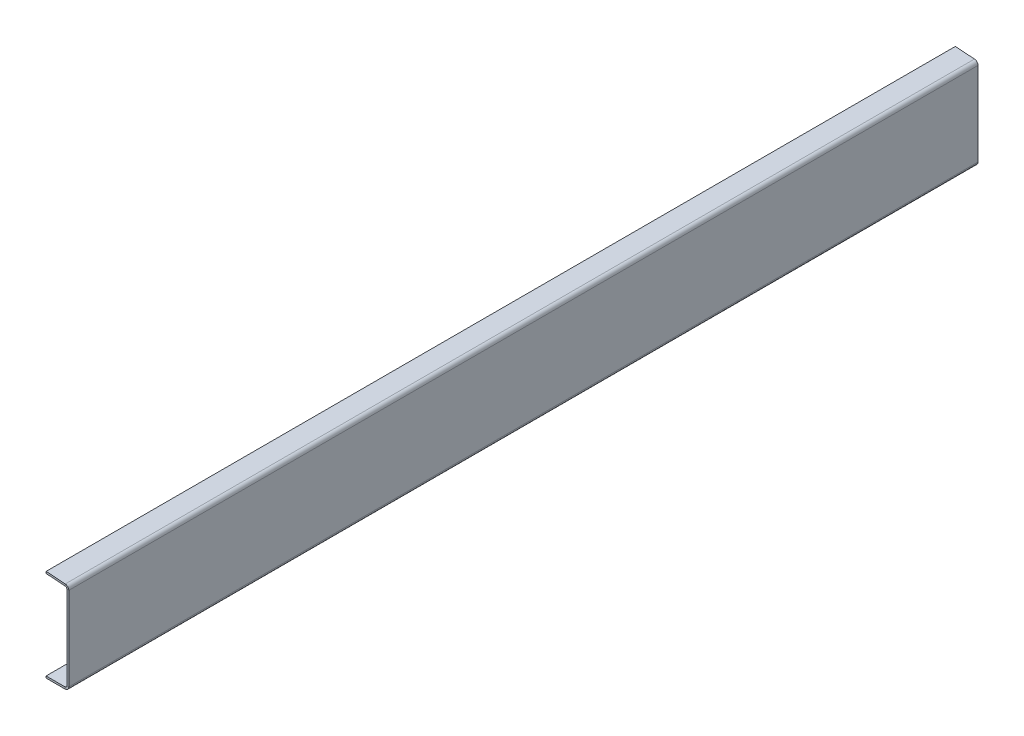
ISO-10303-21;
HEADER;
FILE_DESCRIPTION(('STEP AP214'),'2;1');
FILE_NAME('part.step','',(''),(''),'','','');
FILE_SCHEMA(('AUTOMOTIVE_DESIGN { 1 0 10303 214 1 1 1 1 }'));
ENDSEC;
DATA;
#1=APPLICATION_CONTEXT('core data for automotive mechanical design processes');
#2=APPLICATION_PROTOCOL_DEFINITION('international standard','automotive_design',2000,#1);
#3=PRODUCT_CONTEXT('',#1,'mechanical');
#4=PRODUCT('Part','Part','',(#3));
#5=PRODUCT_RELATED_PRODUCT_CATEGORY('part','',(#4));
#6=PRODUCT_DEFINITION_FORMATION('','',#4);
#7=PRODUCT_DEFINITION_CONTEXT('part definition',#1,'design');
#8=PRODUCT_DEFINITION('design','',#6,#7);
#9=PRODUCT_DEFINITION_SHAPE('','',#8);
#10=(LENGTH_UNIT() NAMED_UNIT(*) SI_UNIT(.MILLI.,.METRE.));
#11=(NAMED_UNIT(*) PLANE_ANGLE_UNIT() SI_UNIT($,.RADIAN.));
#12=(NAMED_UNIT(*) SI_UNIT($,.STERADIAN.) SOLID_ANGLE_UNIT());
#13=UNCERTAINTY_MEASURE_WITH_UNIT(LENGTH_MEASURE(1.E-05),#10,'distance_accuracy_value','');
#14=(GEOMETRIC_REPRESENTATION_CONTEXT(3) GLOBAL_UNCERTAINTY_ASSIGNED_CONTEXT((#13)) GLOBAL_UNIT_ASSIGNED_CONTEXT((#10,
#11,#12)) REPRESENTATION_CONTEXT('',''));
#15=CARTESIAN_POINT('',(0.,0.,0.));
#16=DIRECTION('',(0.,0.,1.));
#17=DIRECTION('',(1.,0.,0.));
#18=AXIS2_PLACEMENT_3D('',#15,#16,#17);
#19=CARTESIAN_POINT('',(0.,292.957058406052,3048.));
#20=DIRECTION('',(0.,0.,1.));
#21=DIRECTION('',(1.,0.,0.));
#22=AXIS2_PLACEMENT_3D('',#19,#20,#21);
#23=PLANE('',#22);
#24=DIRECTION('',(-1.,0.,0.));
#25=VECTOR('',#24,1.);
#26=CARTESIAN_POINT('',(0.,292.957058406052,3048.));
#27=LINE('',#26,#25);
#28=CARTESIAN_POINT('',(0.,292.957058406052,3048.));
#29=VERTEX_POINT('',#28);
#30=CARTESIAN_POINT('',(-6.35,292.957058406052,3048.));
#31=VERTEX_POINT('',#30);
#32=EDGE_CURVE('E11',#29,#31,#27,.T.);
#33=ORIENTED_EDGE('',*,*,#32,.F.);
#34=CARTESIAN_POINT('',(-12.7,292.957058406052,3048.));
#35=DIRECTION('',(0.,0.,1.));
#36=DIRECTION('',(1.,0.,0.));
#37=AXIS2_PLACEMENT_3D('',#34,#35,#36);
#38=CIRCLE('',#37,12.7);
#39=CARTESIAN_POINT('',(-11.8140927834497,305.626121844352,3048.));
#40=VERTEX_POINT('',#39);
#41=EDGE_CURVE('E171',#29,#40,#38,.T.);
#42=ORIENTED_EDGE('',*,*,#41,.T.);
#43=DIRECTION('',(0.069756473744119,0.997564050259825,0.));
#44=VECTOR('',#43,1.);
#45=CARTESIAN_POINT('',(-12.2570463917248,299.291590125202,3048.));
#46=LINE('',#45,#44);
#47=CARTESIAN_POINT('',(-12.2570463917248,299.291590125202,3048.));
#48=VERTEX_POINT('',#47);
#49=EDGE_CURVE('E46',#48,#40,#46,.T.);
#50=ORIENTED_EDGE('',*,*,#49,.F.);
#51=CARTESIAN_POINT('',(-12.7,292.957058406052,3048.));
#52=DIRECTION('',(0.,0.,1.));
#53=DIRECTION('',(1.,0.,0.));
#54=AXIS2_PLACEMENT_3D('',#51,#52,#53);
#55=CIRCLE('',#54,6.35);
#56=EDGE_CURVE('E247',#31,#48,#55,.T.);
#57=ORIENTED_EDGE('',*,*,#56,.F.);
#58=EDGE_LOOP('',(#33,#42,#50,#57));
#59=FACE_BOUND('',#58,.T.);
#60=ADVANCED_FACE('F38',(#59),#23,.T.);
#61=CARTESIAN_POINT('',(-12.2570463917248,299.291590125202,3048.));
#62=DIRECTION('',(0.,0.,1.));
#63=DIRECTION('',(1.,0.,0.));
#64=AXIS2_PLACEMENT_3D('',#61,#62,#63);
#65=PLANE('',#64);
#66=DIRECTION('',(0.,1.,0.));
#67=VECTOR('',#66,1.);
#68=CARTESIAN_POINT('',(0.,0.,3048.));
#69=LINE('',#68,#67);
#70=CARTESIAN_POINT('',(0.,12.7,3048.));
#71=VERTEX_POINT('',#70);
#72=EDGE_CURVE('E138',#71,#29,#69,.T.);
#73=ORIENTED_EDGE('',*,*,#72,.T.);
#74=ORIENTED_EDGE('',*,*,#32,.T.);
#75=DIRECTION('',(0.,1.,0.));
#76=VECTOR('',#75,1.);
#77=CARTESIAN_POINT('',(-6.35,0.,3048.));
#78=LINE('',#77,#76);
#79=CARTESIAN_POINT('',(-6.35,12.7,3048.));
#80=VERTEX_POINT('',#79);
#81=EDGE_CURVE('E141',#80,#31,#78,.T.);
#82=ORIENTED_EDGE('',*,*,#81,.F.);
#83=DIRECTION('',(1.,0.,0.));
#84=VECTOR('',#83,1.);
#85=CARTESIAN_POINT('',(-6.35,12.7,3048.));
#86=LINE('',#85,#84);
#87=EDGE_CURVE('E134',#80,#71,#86,.T.);
#88=ORIENTED_EDGE('',*,*,#87,.T.);
#89=EDGE_LOOP('',(#73,#74,#82,#88));
#90=FACE_BOUND('',#89,.T.);
#91=ADVANCED_FACE('F136',(#90),#65,.T.);
#92=CARTESIAN_POINT('',(-11.8140927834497,305.626121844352,0.));
#93=DIRECTION('',(0.,0.,-1.));
#94=DIRECTION('',(-1.,0.,0.));
#95=AXIS2_PLACEMENT_3D('',#92,#93,#94);
#96=PLANE('',#95);
#97=DIRECTION('',(-0.069756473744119,-0.997564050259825,0.));
#98=VECTOR('',#97,1.);
#99=CARTESIAN_POINT('',(-11.8140927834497,305.626121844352,0.));
#100=LINE('',#99,#98);
#101=CARTESIAN_POINT('',(-11.8140927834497,305.626121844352,0.));
#102=VERTEX_POINT('',#101);
#103=CARTESIAN_POINT('',(-12.2570463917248,299.291590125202,0.));
#104=VERTEX_POINT('',#103);
#105=EDGE_CURVE('E101',#102,#104,#100,.T.);
#106=ORIENTED_EDGE('',*,*,#105,.F.);
#107=CARTESIAN_POINT('',(-12.7,292.957058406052,0.));
#108=DIRECTION('',(0.,0.,1.));
#109=DIRECTION('',(1.,0.,0.));
#110=AXIS2_PLACEMENT_3D('',#107,#108,#109);
#111=CIRCLE('',#110,12.7);
#112=CARTESIAN_POINT('',(0.,292.957058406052,0.));
#113=VERTEX_POINT('',#112);
#114=EDGE_CURVE('E205',#113,#102,#111,.T.);
#115=ORIENTED_EDGE('',*,*,#114,.F.);
#116=DIRECTION('',(1.,0.,0.));
#117=VECTOR('',#116,1.);
#118=CARTESIAN_POINT('',(-6.35,292.957058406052,0.));
#119=LINE('',#118,#117);
#120=CARTESIAN_POINT('',(-6.35,292.957058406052,0.));
#121=VERTEX_POINT('',#120);
#122=EDGE_CURVE('E94',#121,#113,#119,.T.);
#123=ORIENTED_EDGE('',*,*,#122,.F.);
#124=CARTESIAN_POINT('',(-12.7,292.957058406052,0.));
#125=DIRECTION('',(0.,0.,1.));
#126=DIRECTION('',(1.,0.,0.));
#127=AXIS2_PLACEMENT_3D('',#124,#125,#126);
#128=CIRCLE('',#127,6.35);
#129=EDGE_CURVE('E186',#121,#104,#128,.T.);
#130=ORIENTED_EDGE('',*,*,#129,.T.);
#131=EDGE_LOOP('',(#106,#115,#123,#130));
#132=FACE_BOUND('',#131,.T.);
#133=ADVANCED_FACE('F252',(#132),#96,.T.);
#134=CARTESIAN_POINT('',(-6.35,292.957058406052,0.));
#135=DIRECTION('',(0.,0.,-1.));
#136=DIRECTION('',(-1.,0.,0.));
#137=AXIS2_PLACEMENT_3D('',#134,#135,#136);
#138=PLANE('',#137);
#139=DIRECTION('',(-0.997564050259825,0.0697564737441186,0.));
#140=VECTOR('',#139,1.);
#141=CARTESIAN_POINT('',(0.,304.8,0.));
#142=LINE('',#141,#140);
#143=CARTESIAN_POINT('',(-76.0143806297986,310.115443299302,0.));
#144=VERTEX_POINT('',#143);
#145=EDGE_CURVE('E177',#102,#144,#142,.T.);
#146=ORIENTED_EDGE('',*,*,#145,.F.);
#147=ORIENTED_EDGE('',*,*,#105,.T.);
#148=DIRECTION('',(-0.997564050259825,0.0697564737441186,0.));
#149=VECTOR('',#148,1.);
#150=CARTESIAN_POINT('',(-0.442953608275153,298.46546828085,0.));
#151=LINE('',#150,#149);
#152=CARTESIAN_POINT('',(-76.4573342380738,303.780911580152,0.));
#153=VERTEX_POINT('',#152);
#154=EDGE_CURVE('E183',#104,#153,#151,.T.);
#155=ORIENTED_EDGE('',*,*,#154,.T.);
#156=DIRECTION('',(0.0697564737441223,0.997564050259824,0.));
#157=VECTOR('',#156,1.);
#158=CARTESIAN_POINT('',(-76.4573342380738,303.780911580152,0.));
#159=LINE('',#158,#157);
#160=EDGE_CURVE('E180',#153,#144,#159,.T.);
#161=ORIENTED_EDGE('',*,*,#160,.T.);
#162=EDGE_LOOP('',(#146,#147,#155,#161));
#163=FACE_BOUND('',#162,.T.);
#164=ADVANCED_FACE('F238',(#163),#138,.T.);
#165=CARTESIAN_POINT('',(-12.7,0.,3048.));
#166=DIRECTION('',(0.,0.,1.));
#167=DIRECTION('',(1.,0.,0.));
#168=AXIS2_PLACEMENT_3D('',#165,#166,#167);
#169=PLANE('',#168);
#170=DIRECTION('',(0.,1.,0.));
#171=VECTOR('',#170,1.);
#172=CARTESIAN_POINT('',(-12.7,0.,3048.));
#173=LINE('',#172,#171);
#174=CARTESIAN_POINT('',(-12.7,0.,3048.));
#175=VERTEX_POINT('',#174);
#176=CARTESIAN_POINT('',(-12.7,6.35,3048.));
#177=VERTEX_POINT('',#176);
#178=EDGE_CURVE('E146',#175,#177,#173,.T.);
#179=ORIENTED_EDGE('',*,*,#178,.F.);
#180=CARTESIAN_POINT('',(-12.7,12.7,3048.));
#181=DIRECTION('',(0.,0.,1.));
#182=DIRECTION('',(1.,0.,0.));
#183=AXIS2_PLACEMENT_3D('',#180,#181,#182);
#184=CIRCLE('',#183,12.7);
#185=EDGE_CURVE('E150',#175,#71,#184,.T.);
#186=ORIENTED_EDGE('',*,*,#185,.T.);
#187=ORIENTED_EDGE('',*,*,#87,.F.);
#188=CARTESIAN_POINT('',(-12.7,12.7,3048.));
#189=DIRECTION('',(0.,0.,1.));
#190=DIRECTION('',(1.,0.,0.));
#191=AXIS2_PLACEMENT_3D('',#188,#189,#190);
#192=CIRCLE('',#191,6.35);
#193=EDGE_CURVE('E259',#177,#80,#192,.T.);
#194=ORIENTED_EDGE('',*,*,#193,.F.);
#195=EDGE_LOOP('',(#179,#186,#187,#194));
#196=FACE_BOUND('',#195,.T.);
#197=ADVANCED_FACE('F152',(#196),#169,.T.);
#198=CARTESIAN_POINT('',(-6.35,12.7,3048.));
#199=DIRECTION('',(0.,0.,1.));
#200=DIRECTION('',(1.,0.,0.));
#201=AXIS2_PLACEMENT_3D('',#198,#199,#200);
#202=PLANE('',#201);
#203=DIRECTION('',(1.,0.,0.));
#204=VECTOR('',#203,1.);
#205=CARTESIAN_POINT('',(-76.2,0.,3048.));
#206=LINE('',#205,#204);
#207=CARTESIAN_POINT('',(-76.2,0.,3048.));
#208=VERTEX_POINT('',#207);
#209=EDGE_CURVE('E156',#208,#175,#206,.T.);
#210=ORIENTED_EDGE('',*,*,#209,.T.);
#211=ORIENTED_EDGE('',*,*,#178,.T.);
#212=DIRECTION('',(1.,0.,0.));
#213=VECTOR('',#212,1.);
#214=CARTESIAN_POINT('',(-76.2,6.35,3048.));
#215=LINE('',#214,#213);
#216=CARTESIAN_POINT('',(-76.2,6.35,3048.));
#217=VERTEX_POINT('',#216);
#218=EDGE_CURVE('E266',#217,#177,#215,.T.);
#219=ORIENTED_EDGE('',*,*,#218,.F.);
#220=DIRECTION('',(0.,1.,0.));
#221=VECTOR('',#220,1.);
#222=CARTESIAN_POINT('',(-76.2,0.,3048.));
#223=LINE('',#222,#221);
#224=EDGE_CURVE('E269',#208,#217,#223,.T.);
#225=ORIENTED_EDGE('',*,*,#224,.F.);
#226=EDGE_LOOP('',(#210,#211,#219,#225));
#227=FACE_BOUND('',#226,.T.);
#228=ADVANCED_FACE('F275',(#227),#202,.T.);
#229=CARTESIAN_POINT('',(0.,12.7,0.));
#230=DIRECTION('',(0.,0.,-1.));
#231=DIRECTION('',(-1.,0.,0.));
#232=AXIS2_PLACEMENT_3D('',#229,#230,#231);
#233=PLANE('',#232);
#234=DIRECTION('',(-1.,0.,0.));
#235=VECTOR('',#234,1.);
#236=CARTESIAN_POINT('',(0.,12.7,0.));
#237=LINE('',#236,#235);
#238=CARTESIAN_POINT('',(0.,12.7,0.));
#239=VERTEX_POINT('',#238);
#240=CARTESIAN_POINT('',(-6.35,12.7,0.));
#241=VERTEX_POINT('',#240);
#242=EDGE_CURVE('E147',#239,#241,#237,.T.);
#243=ORIENTED_EDGE('',*,*,#242,.F.);
#244=CARTESIAN_POINT('',(-12.7,12.7,0.));
#245=DIRECTION('',(0.,0.,1.));
#246=DIRECTION('',(1.,0.,0.));
#247=AXIS2_PLACEMENT_3D('',#244,#245,#246);
#248=CIRCLE('',#247,12.7);
#249=CARTESIAN_POINT('',(-12.7,0.,0.));
#250=VERTEX_POINT('',#249);
#251=EDGE_CURVE('E163',#250,#239,#248,.T.);
#252=ORIENTED_EDGE('',*,*,#251,.F.);
#253=DIRECTION('',(0.,-1.,0.));
#254=VECTOR('',#253,1.);
#255=CARTESIAN_POINT('',(-12.7,6.35,0.));
#256=LINE('',#255,#254);
#257=CARTESIAN_POINT('',(-12.7,6.35,0.));
#258=VERTEX_POINT('',#257);
#259=EDGE_CURVE('E231',#258,#250,#256,.T.);
#260=ORIENTED_EDGE('',*,*,#259,.F.);
#261=CARTESIAN_POINT('',(-12.7,12.7,0.));
#262=DIRECTION('',(0.,0.,1.));
#263=DIRECTION('',(1.,0.,0.));
#264=AXIS2_PLACEMENT_3D('',#261,#262,#263);
#265=CIRCLE('',#264,6.35);
#266=EDGE_CURVE('E190',#258,#241,#265,.T.);
#267=ORIENTED_EDGE('',*,*,#266,.T.);
#268=EDGE_LOOP('',(#243,#252,#260,#267));
#269=FACE_BOUND('',#268,.T.);
#270=ADVANCED_FACE('F282',(#269),#233,.T.);
#271=CARTESIAN_POINT('',(-12.7,6.35,0.));
#272=DIRECTION('',(0.,0.,-1.));
#273=DIRECTION('',(-1.,0.,0.));
#274=AXIS2_PLACEMENT_3D('',#271,#272,#273);
#275=PLANE('',#274);
#276=DIRECTION('',(0.,1.,0.));
#277=VECTOR('',#276,1.);
#278=CARTESIAN_POINT('',(0.,0.,0.));
#279=LINE('',#278,#277);
#280=EDGE_CURVE('E203',#239,#113,#279,.T.);
#281=ORIENTED_EDGE('',*,*,#280,.F.);
#282=ORIENTED_EDGE('',*,*,#242,.T.);
#283=DIRECTION('',(0.,1.,0.));
#284=VECTOR('',#283,1.);
#285=CARTESIAN_POINT('',(-6.35,0.,0.));
#286=LINE('',#285,#284);
#287=EDGE_CURVE('E188',#241,#121,#286,.T.);
#288=ORIENTED_EDGE('',*,*,#287,.T.);
#289=ORIENTED_EDGE('',*,*,#122,.T.);
#290=EDGE_LOOP('',(#281,#282,#288,#289));
#291=FACE_BOUND('',#290,.T.);
#292=ADVANCED_FACE('F284',(#291),#275,.T.);
#293=CARTESIAN_POINT('',(0.,304.8,3048.));
#294=DIRECTION('',(-0.0697564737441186,-0.997564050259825,0.));
#295=DIRECTION('',(0.997564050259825,-0.0697564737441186,0.));
#296=AXIS2_PLACEMENT_3D('',#293,#294,#295);
#297=PLANE('',#296);
#298=ORIENTED_EDGE('',*,*,#145,.T.);
#299=DIRECTION('',(0.,0.,-1.));
#300=VECTOR('',#299,1.);
#301=CARTESIAN_POINT('',(-76.0143806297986,310.115443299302,3048.));
#302=LINE('',#301,#300);
#303=CARTESIAN_POINT('',(-76.0143806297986,310.115443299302,3048.));
#304=VERTEX_POINT('',#303);
#305=EDGE_CURVE('E229',#304,#144,#302,.T.);
#306=ORIENTED_EDGE('',*,*,#305,.F.);
#307=DIRECTION('',(-0.997564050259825,0.0697564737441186,0.));
#308=VECTOR('',#307,1.);
#309=CARTESIAN_POINT('',(0.,304.8,3048.));
#310=LINE('',#309,#308);
#311=EDGE_CURVE('E107',#40,#304,#310,.T.);
#312=ORIENTED_EDGE('',*,*,#311,.F.);
#313=DIRECTION('',(0.,0.,-1.));
#314=VECTOR('',#313,1.);
#315=CARTESIAN_POINT('',(-11.8140927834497,305.626121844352,3048.));
#316=LINE('',#315,#314);
#317=EDGE_CURVE('E173',#40,#102,#316,.T.);
#318=ORIENTED_EDGE('',*,*,#317,.T.);
#319=EDGE_LOOP('',(#298,#306,#312,#318));
#320=FACE_BOUND('',#319,.T.);
#321=ADVANCED_FACE('F323',(#320),#297,.F.);
#322=CARTESIAN_POINT('',(-76.4573342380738,303.780911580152,3048.));
#323=DIRECTION('',(-0.997564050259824,0.0697564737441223,0.));
#324=DIRECTION('',(-0.0697564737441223,-0.997564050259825,0.));
#325=AXIS2_PLACEMENT_3D('',#322,#323,#324);
#326=PLANE('',#325);
#327=ORIENTED_EDGE('',*,*,#160,.F.);
#328=DIRECTION('',(0.,0.,-1.));
#329=VECTOR('',#328,1.);
#330=CARTESIAN_POINT('',(-76.4573342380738,303.780911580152,3048.));
#331=LINE('',#330,#329);
#332=CARTESIAN_POINT('',(-76.4573342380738,303.780911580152,3048.));
#333=VERTEX_POINT('',#332);
#334=EDGE_CURVE('E227',#333,#153,#331,.T.);
#335=ORIENTED_EDGE('',*,*,#334,.F.);
#336=DIRECTION('',(0.0697564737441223,0.997564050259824,0.));
#337=VECTOR('',#336,1.);
#338=CARTESIAN_POINT('',(-76.4573342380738,303.780911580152,3048.));
#339=LINE('',#338,#337);
#340=EDGE_CURVE('E261',#333,#304,#339,.T.);
#341=ORIENTED_EDGE('',*,*,#340,.T.);
#342=ORIENTED_EDGE('',*,*,#305,.T.);
#343=EDGE_LOOP('',(#327,#335,#341,#342));
#344=FACE_BOUND('',#343,.T.);
#345=ADVANCED_FACE('F326',(#344),#326,.T.);
#346=CARTESIAN_POINT('',(-0.442953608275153,298.46546828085,3048.));
#347=DIRECTION('',(-0.0697564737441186,-0.997564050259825,0.));
#348=DIRECTION('',(0.997564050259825,-0.0697564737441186,0.));
#349=AXIS2_PLACEMENT_3D('',#346,#347,#348);
#350=PLANE('',#349);
#351=ORIENTED_EDGE('',*,*,#154,.F.);
#352=DIRECTION('',(0.,0.,-1.));
#353=VECTOR('',#352,1.);
#354=CARTESIAN_POINT('',(-12.2570463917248,299.291590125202,3048.));
#355=LINE('',#354,#353);
#356=EDGE_CURVE('E224',#48,#104,#355,.T.);
#357=ORIENTED_EDGE('',*,*,#356,.F.);
#358=DIRECTION('',(-0.997564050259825,0.0697564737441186,0.));
#359=VECTOR('',#358,1.);
#360=CARTESIAN_POINT('',(-0.442953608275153,298.46546828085,3048.));
#361=LINE('',#360,#359);
#362=EDGE_CURVE('E257',#48,#333,#361,.T.);
#363=ORIENTED_EDGE('',*,*,#362,.T.);
#364=ORIENTED_EDGE('',*,*,#334,.T.);
#365=EDGE_LOOP('',(#351,#357,#363,#364));
#366=FACE_BOUND('',#365,.T.);
#367=ADVANCED_FACE('F250',(#366),#350,.T.);
#368=CARTESIAN_POINT('',(-12.7,292.957058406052,3048.));
#369=DIRECTION('',(0.,0.,-1.));
#370=DIRECTION('',(-1.,0.,0.));
#371=AXIS2_PLACEMENT_3D('',#368,#369,#370);
#372=CYLINDRICAL_SURFACE('',#371,6.35);
#373=ORIENTED_EDGE('',*,*,#129,.F.);
#374=DIRECTION('',(0.,0.,-1.));
#375=VECTOR('',#374,1.);
#376=CARTESIAN_POINT('',(-6.35,292.957058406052,3048.));
#377=LINE('',#376,#375);
#378=EDGE_CURVE('E221',#31,#121,#377,.T.);
#379=ORIENTED_EDGE('',*,*,#378,.F.);
#380=ORIENTED_EDGE('',*,*,#56,.T.);
#381=ORIENTED_EDGE('',*,*,#356,.T.);
#382=EDGE_LOOP('',(#373,#379,#380,#381));
#383=FACE_BOUND('',#382,.T.);
#384=ADVANCED_FACE('F244',(#383),#372,.F.);
#385=CARTESIAN_POINT('',(-6.35,0.,3048.));
#386=DIRECTION('',(-1.,0.,0.));
#387=DIRECTION('',(0.,0.,1.));
#388=AXIS2_PLACEMENT_3D('',#385,#386,#387);
#389=PLANE('',#388);
#390=ORIENTED_EDGE('',*,*,#287,.F.);
#391=DIRECTION('',(0.,0.,-1.));
#392=VECTOR('',#391,1.);
#393=CARTESIAN_POINT('',(-6.35,12.7,3048.));
#394=LINE('',#393,#392);
#395=EDGE_CURVE('E218',#80,#241,#394,.T.);
#396=ORIENTED_EDGE('',*,*,#395,.F.);
#397=ORIENTED_EDGE('',*,*,#81,.T.);
#398=ORIENTED_EDGE('',*,*,#378,.T.);
#399=EDGE_LOOP('',(#390,#396,#397,#398));
#400=FACE_BOUND('',#399,.T.);
#401=ADVANCED_FACE('F255',(#400),#389,.T.);
#402=CARTESIAN_POINT('',(-12.7,12.7,3048.));
#403=DIRECTION('',(0.,0.,-1.));
#404=DIRECTION('',(-1.,0.,0.));
#405=AXIS2_PLACEMENT_3D('',#402,#403,#404);
#406=CYLINDRICAL_SURFACE('',#405,6.35);
#407=ORIENTED_EDGE('',*,*,#266,.F.);
#408=DIRECTION('',(0.,0.,-1.));
#409=VECTOR('',#408,1.);
#410=CARTESIAN_POINT('',(-12.7,6.35,3048.));
#411=LINE('',#410,#409);
#412=EDGE_CURVE('E215',#177,#258,#411,.T.);
#413=ORIENTED_EDGE('',*,*,#412,.F.);
#414=ORIENTED_EDGE('',*,*,#193,.T.);
#415=ORIENTED_EDGE('',*,*,#395,.T.);
#416=EDGE_LOOP('',(#407,#413,#414,#415));
#417=FACE_BOUND('',#416,.T.);
#418=ADVANCED_FACE('F286',(#417),#406,.F.);
#419=CARTESIAN_POINT('',(-76.2,6.35,3048.));
#420=DIRECTION('',(0.,1.,0.));
#421=DIRECTION('',(0.,0.,1.));
#422=AXIS2_PLACEMENT_3D('',#419,#420,#421);
#423=PLANE('',#422);
#424=DIRECTION('',(1.,0.,0.));
#425=VECTOR('',#424,1.);
#426=CARTESIAN_POINT('',(-76.2,6.35,0.));
#427=LINE('',#426,#425);
#428=CARTESIAN_POINT('',(-76.2,6.35,0.));
#429=VERTEX_POINT('',#428);
#430=EDGE_CURVE('E193',#429,#258,#427,.T.);
#431=ORIENTED_EDGE('',*,*,#430,.F.);
#432=DIRECTION('',(0.,0.,-1.));
#433=VECTOR('',#432,1.);
#434=CARTESIAN_POINT('',(-76.2,6.35,3048.));
#435=LINE('',#434,#433);
#436=EDGE_CURVE('E213',#217,#429,#435,.T.);
#437=ORIENTED_EDGE('',*,*,#436,.F.);
#438=ORIENTED_EDGE('',*,*,#218,.T.);
#439=ORIENTED_EDGE('',*,*,#412,.T.);
#440=EDGE_LOOP('',(#431,#437,#438,#439));
#441=FACE_BOUND('',#440,.T.);
#442=ADVANCED_FACE('F289',(#441),#423,.T.);
#443=CARTESIAN_POINT('',(-76.2,0.,3048.));
#444=DIRECTION('',(-1.,0.,0.));
#445=DIRECTION('',(0.,0.,1.));
#446=AXIS2_PLACEMENT_3D('',#443,#444,#445);
#447=PLANE('',#446);
#448=DIRECTION('',(0.,1.,0.));
#449=VECTOR('',#448,1.);
#450=CARTESIAN_POINT('',(-76.2,0.,0.));
#451=LINE('',#450,#449);
#452=CARTESIAN_POINT('',(-76.2,0.,0.));
#453=VERTEX_POINT('',#452);
#454=EDGE_CURVE('E196',#453,#429,#451,.T.);
#455=ORIENTED_EDGE('',*,*,#454,.F.);
#456=DIRECTION('',(0.,0.,-1.));
#457=VECTOR('',#456,1.);
#458=CARTESIAN_POINT('',(-76.2,0.,3048.));
#459=LINE('',#458,#457);
#460=EDGE_CURVE('E211',#208,#453,#459,.T.);
#461=ORIENTED_EDGE('',*,*,#460,.F.);
#462=ORIENTED_EDGE('',*,*,#224,.T.);
#463=ORIENTED_EDGE('',*,*,#436,.T.);
#464=EDGE_LOOP('',(#455,#461,#462,#463));
#465=FACE_BOUND('',#464,.T.);
#466=ADVANCED_FACE('F292',(#465),#447,.T.);
#467=CARTESIAN_POINT('',(-76.2,0.,3048.));
#468=DIRECTION('',(0.,1.,0.));
#469=DIRECTION('',(0.,0.,1.));
#470=AXIS2_PLACEMENT_3D('',#467,#468,#469);
#471=PLANE('',#470);
#472=DIRECTION('',(1.,0.,0.));
#473=VECTOR('',#472,1.);
#474=CARTESIAN_POINT('',(-76.2,0.,0.));
#475=LINE('',#474,#473);
#476=EDGE_CURVE('E199',#453,#250,#475,.T.);
#477=ORIENTED_EDGE('',*,*,#476,.T.);
#478=DIRECTION('',(0.,0.,-1.));
#479=VECTOR('',#478,1.);
#480=CARTESIAN_POINT('',(-12.7,0.,3048.));
#481=LINE('',#480,#479);
#482=EDGE_CURVE('E165',#175,#250,#481,.T.);
#483=ORIENTED_EDGE('',*,*,#482,.F.);
#484=ORIENTED_EDGE('',*,*,#209,.F.);
#485=ORIENTED_EDGE('',*,*,#460,.T.);
#486=EDGE_LOOP('',(#477,#483,#484,#485));
#487=FACE_BOUND('',#486,.T.);
#488=ADVANCED_FACE('F279',(#487),#471,.F.);
#489=CARTESIAN_POINT('',(-12.7,12.7,3048.));
#490=DIRECTION('',(0.,0.,-1.));
#491=DIRECTION('',(-1.,0.,0.));
#492=AXIS2_PLACEMENT_3D('',#489,#490,#491);
#493=CYLINDRICAL_SURFACE('',#492,12.7);
#494=ORIENTED_EDGE('',*,*,#251,.T.);
#495=DIRECTION('',(0.,0.,-1.));
#496=VECTOR('',#495,1.);
#497=CARTESIAN_POINT('',(0.,12.7,3048.));
#498=LINE('',#497,#496);
#499=EDGE_CURVE('E160',#71,#239,#498,.T.);
#500=ORIENTED_EDGE('',*,*,#499,.F.);
#501=ORIENTED_EDGE('',*,*,#185,.F.);
#502=ORIENTED_EDGE('',*,*,#482,.T.);
#503=EDGE_LOOP('',(#494,#500,#501,#502));
#504=FACE_BOUND('',#503,.T.);
#505=ADVANCED_FACE('F161',(#504),#493,.T.);
#506=CARTESIAN_POINT('',(0.,0.,3048.));
#507=DIRECTION('',(-1.,0.,0.));
#508=DIRECTION('',(0.,0.,1.));
#509=AXIS2_PLACEMENT_3D('',#506,#507,#508);
#510=PLANE('',#509);
#511=ORIENTED_EDGE('',*,*,#280,.T.);
#512=DIRECTION('',(0.,0.,-1.));
#513=VECTOR('',#512,1.);
#514=CARTESIAN_POINT('',(0.,292.957058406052,3048.));
#515=LINE('',#514,#513);
#516=EDGE_CURVE('E166',#29,#113,#515,.T.);
#517=ORIENTED_EDGE('',*,*,#516,.F.);
#518=ORIENTED_EDGE('',*,*,#72,.F.);
#519=ORIENTED_EDGE('',*,*,#499,.T.);
#520=EDGE_LOOP('',(#511,#517,#518,#519));
#521=FACE_BOUND('',#520,.T.);
#522=ADVANCED_FACE('F168',(#521),#510,.F.);
#523=CARTESIAN_POINT('',(-12.7,292.957058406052,3048.));
#524=DIRECTION('',(0.,0.,-1.));
#525=DIRECTION('',(-1.,0.,0.));
#526=AXIS2_PLACEMENT_3D('',#523,#524,#525);
#527=CYLINDRICAL_SURFACE('',#526,12.7);
#528=ORIENTED_EDGE('',*,*,#114,.T.);
#529=ORIENTED_EDGE('',*,*,#317,.F.);
#530=ORIENTED_EDGE('',*,*,#41,.F.);
#531=ORIENTED_EDGE('',*,*,#516,.T.);
#532=EDGE_LOOP('',(#528,#529,#530,#531));
#533=FACE_BOUND('',#532,.T.);
#534=ADVANCED_FACE('F301',(#533),#527,.T.);
#535=CARTESIAN_POINT('',(-12.7,292.957058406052,3048.));
#536=DIRECTION('',(0.,0.,1.));
#537=DIRECTION('',(1.,0.,0.));
#538=AXIS2_PLACEMENT_3D('',#535,#536,#537);
#539=PLANE('',#538);
#540=ORIENTED_EDGE('',*,*,#311,.T.);
#541=ORIENTED_EDGE('',*,*,#340,.F.);
#542=ORIENTED_EDGE('',*,*,#362,.F.);
#543=ORIENTED_EDGE('',*,*,#49,.T.);
#544=EDGE_LOOP('',(#540,#541,#542,#543));
#545=FACE_BOUND('',#544,.T.);
#546=ADVANCED_FACE('F296',(#545),#539,.T.);
#547=CARTESIAN_POINT('',(-12.7,292.957058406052,0.));
#548=DIRECTION('',(0.,0.,1.));
#549=DIRECTION('',(1.,0.,0.));
#550=AXIS2_PLACEMENT_3D('',#547,#548,#549);
#551=PLANE('',#550);
#552=ORIENTED_EDGE('',*,*,#430,.T.);
#553=ORIENTED_EDGE('',*,*,#259,.T.);
#554=ORIENTED_EDGE('',*,*,#476,.F.);
#555=ORIENTED_EDGE('',*,*,#454,.T.);
#556=EDGE_LOOP('',(#552,#553,#554,#555));
#557=FACE_BOUND('',#556,.T.);
#558=ADVANCED_FACE('F294',(#557),#551,.F.);
#559=CLOSED_SHELL('',(#60,#91,#133,#164,#197,#228,#270,#292,#321,#345,#367,#384,#401,#418,#442,
#466,#488,#505,#522,#534,#546,#558));
#560=MANIFOLD_SOLID_BREP('B2',#559);
#561=ADVANCED_BREP_SHAPE_REPRESENTATION('',(#18,#560),#14);
#562=SHAPE_DEFINITION_REPRESENTATION(#9,#561);
ENDSEC;
END-ISO-10303-21;
